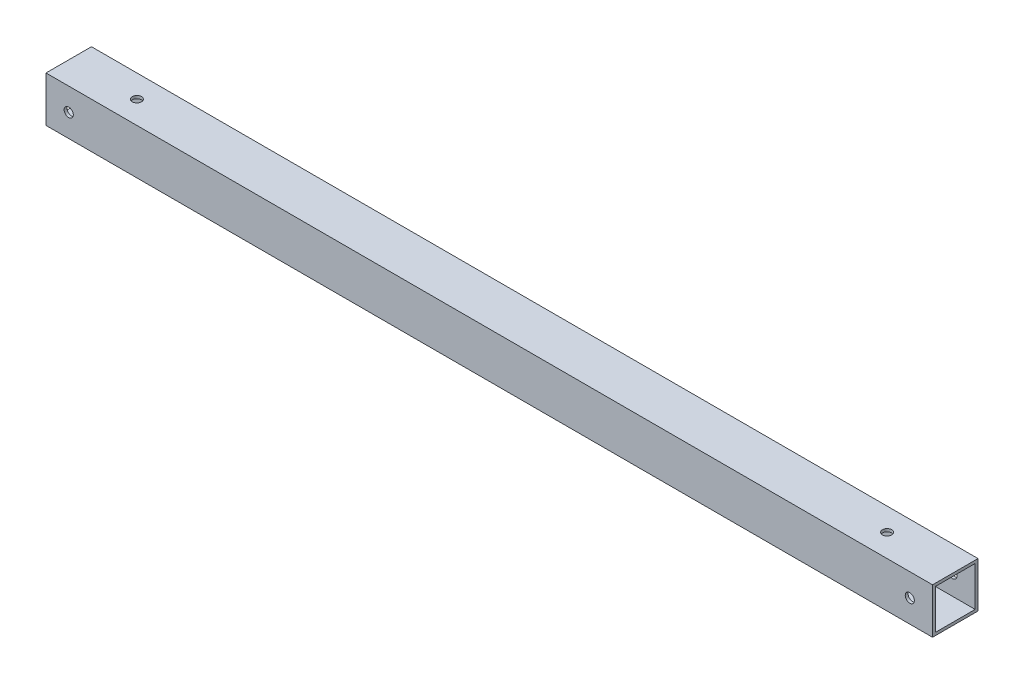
ISO-10303-21;
HEADER;
FILE_DESCRIPTION(('STEP AP214'),'2;1');
FILE_NAME('part.step','',(''),(''),'','','');
FILE_SCHEMA(('AUTOMOTIVE_DESIGN { 1 0 10303 214 1 1 1 1 }'));
ENDSEC;
DATA;
#1=APPLICATION_CONTEXT('core data for automotive mechanical design processes');
#2=APPLICATION_PROTOCOL_DEFINITION('international standard','automotive_design',2000,#1);
#3=PRODUCT_CONTEXT('',#1,'mechanical');
#4=PRODUCT('Part','Part','',(#3));
#5=PRODUCT_RELATED_PRODUCT_CATEGORY('part','',(#4));
#6=PRODUCT_DEFINITION_FORMATION('','',#4);
#7=PRODUCT_DEFINITION_CONTEXT('part definition',#1,'design');
#8=PRODUCT_DEFINITION('design','',#6,#7);
#9=PRODUCT_DEFINITION_SHAPE('','',#8);
#10=(LENGTH_UNIT() NAMED_UNIT(*) SI_UNIT(.MILLI.,.METRE.));
#11=(NAMED_UNIT(*) PLANE_ANGLE_UNIT() SI_UNIT($,.RADIAN.));
#12=(NAMED_UNIT(*) SI_UNIT($,.STERADIAN.) SOLID_ANGLE_UNIT());
#13=UNCERTAINTY_MEASURE_WITH_UNIT(LENGTH_MEASURE(1.E-05),#10,'distance_accuracy_value','');
#14=(GEOMETRIC_REPRESENTATION_CONTEXT(3) GLOBAL_UNCERTAINTY_ASSIGNED_CONTEXT((#13)) GLOBAL_UNIT_ASSIGNED_CONTEXT((#10,
#11,#12)) REPRESENTATION_CONTEXT('',''));
#15=CARTESIAN_POINT('',(0.,0.,0.));
#16=DIRECTION('',(0.,0.,1.));
#17=DIRECTION('',(1.,0.,0.));
#18=AXIS2_PLACEMENT_3D('',#15,#16,#17);
#19=CARTESIAN_POINT('',(495.3,0.,0.));
#20=DIRECTION('',(-1.,0.,0.));
#21=DIRECTION('',(0.,0.,1.));
#22=AXIS2_PLACEMENT_3D('',#19,#20,#21);
#23=PLANE('',#22);
#24=DIRECTION('',(0.,1.,0.));
#25=VECTOR('',#24,1.);
#26=CARTESIAN_POINT('',(495.3,-12.7,-12.7));
#27=LINE('',#26,#25);
#28=CARTESIAN_POINT('',(495.3,-12.7,-12.7));
#29=VERTEX_POINT('',#28);
#30=CARTESIAN_POINT('',(495.3,12.7,-12.7));
#31=VERTEX_POINT('',#30);
#32=EDGE_CURVE('E155',#29,#31,#27,.T.);
#33=ORIENTED_EDGE('',*,*,#32,.T.);
#34=DIRECTION('',(0.,0.,1.));
#35=VECTOR('',#34,1.);
#36=CARTESIAN_POINT('',(495.3,12.7,12.7));
#37=LINE('',#36,#35);
#38=CARTESIAN_POINT('',(495.3,12.7,12.7));
#39=VERTEX_POINT('',#38);
#40=EDGE_CURVE('E159',#31,#39,#37,.T.);
#41=ORIENTED_EDGE('',*,*,#40,.T.);
#42=DIRECTION('',(0.,-1.,0.));
#43=VECTOR('',#42,1.);
#44=CARTESIAN_POINT('',(495.3,-12.7,12.7));
#45=LINE('',#44,#43);
#46=CARTESIAN_POINT('',(495.3,-12.7,12.7));
#47=VERTEX_POINT('',#46);
#48=EDGE_CURVE('E163',#39,#47,#45,.T.);
#49=ORIENTED_EDGE('',*,*,#48,.T.);
#50=DIRECTION('',(0.,0.,-1.));
#51=VECTOR('',#50,1.);
#52=CARTESIAN_POINT('',(495.3,-12.7,12.7));
#53=LINE('',#52,#51);
#54=EDGE_CURVE('E166',#47,#29,#53,.T.);
#55=ORIENTED_EDGE('',*,*,#54,.T.);
#56=EDGE_LOOP('',(#33,#41,#49,#55));
#57=FACE_BOUND('',#56,.T.);
#58=DIRECTION('',(0.,1.,0.));
#59=VECTOR('',#58,1.);
#60=CARTESIAN_POINT('',(495.3,-11.1125,-11.1125));
#61=LINE('',#60,#59);
#62=CARTESIAN_POINT('',(495.3,-11.1125,-11.1125));
#63=VERTEX_POINT('',#62);
#64=CARTESIAN_POINT('',(495.3,11.1125,-11.1125));
#65=VERTEX_POINT('',#64);
#66=EDGE_CURVE('E104',#63,#65,#61,.T.);
#67=ORIENTED_EDGE('',*,*,#66,.F.);
#68=DIRECTION('',(0.,0.,-1.));
#69=VECTOR('',#68,1.);
#70=CARTESIAN_POINT('',(495.3,-11.1125,11.1125));
#71=LINE('',#70,#69);
#72=CARTESIAN_POINT('',(495.3,-11.1125,11.1125));
#73=VERTEX_POINT('',#72);
#74=EDGE_CURVE('E131',#73,#63,#71,.T.);
#75=ORIENTED_EDGE('',*,*,#74,.F.);
#76=DIRECTION('',(0.,-1.,0.));
#77=VECTOR('',#76,1.);
#78=CARTESIAN_POINT('',(495.3,-11.1125,11.1125));
#79=LINE('',#78,#77);
#80=CARTESIAN_POINT('',(495.3,11.1125,11.1125));
#81=VERTEX_POINT('',#80);
#82=EDGE_CURVE('E126',#81,#73,#79,.T.);
#83=ORIENTED_EDGE('',*,*,#82,.F.);
#84=DIRECTION('',(0.,0.,1.));
#85=VECTOR('',#84,1.);
#86=CARTESIAN_POINT('',(495.3,11.1125,11.1125));
#87=LINE('',#86,#85);
#88=EDGE_CURVE('E113',#65,#81,#87,.T.);
#89=ORIENTED_EDGE('',*,*,#88,.F.);
#90=EDGE_LOOP('',(#67,#75,#83,#89));
#91=FACE_BOUND('',#90,.T.);
#92=ADVANCED_FACE('F36',(#57,#91),#23,.F.);
#93=CARTESIAN_POINT('',(0.,0.,0.));
#94=DIRECTION('',(-1.,0.,0.));
#95=DIRECTION('',(0.,0.,1.));
#96=AXIS2_PLACEMENT_3D('',#93,#94,#95);
#97=PLANE('',#96);
#98=DIRECTION('',(0.,1.,0.));
#99=VECTOR('',#98,1.);
#100=CARTESIAN_POINT('',(0.,-12.7,-12.7));
#101=LINE('',#100,#99);
#102=CARTESIAN_POINT('',(0.,-12.7,-12.7));
#103=VERTEX_POINT('',#102);
#104=CARTESIAN_POINT('',(0.,12.7,-12.7));
#105=VERTEX_POINT('',#104);
#106=EDGE_CURVE('E122',#103,#105,#101,.T.);
#107=ORIENTED_EDGE('',*,*,#106,.F.);
#108=DIRECTION('',(0.,0.,-1.));
#109=VECTOR('',#108,1.);
#110=CARTESIAN_POINT('',(0.,-12.7,12.7));
#111=LINE('',#110,#109);
#112=CARTESIAN_POINT('',(0.,-12.7,12.7));
#113=VERTEX_POINT('',#112);
#114=EDGE_CURVE('E160',#113,#103,#111,.T.);
#115=ORIENTED_EDGE('',*,*,#114,.F.);
#116=DIRECTION('',(0.,-1.,0.));
#117=VECTOR('',#116,1.);
#118=CARTESIAN_POINT('',(0.,-12.7,12.7));
#119=LINE('',#118,#117);
#120=CARTESIAN_POINT('',(0.,12.7,12.7));
#121=VERTEX_POINT('',#120);
#122=EDGE_CURVE('E176',#121,#113,#119,.T.);
#123=ORIENTED_EDGE('',*,*,#122,.F.);
#124=DIRECTION('',(0.,0.,1.));
#125=VECTOR('',#124,1.);
#126=CARTESIAN_POINT('',(0.,12.7,12.7));
#127=LINE('',#126,#125);
#128=EDGE_CURVE('E173',#105,#121,#127,.T.);
#129=ORIENTED_EDGE('',*,*,#128,.F.);
#130=EDGE_LOOP('',(#107,#115,#123,#129));
#131=FACE_BOUND('',#130,.T.);
#132=DIRECTION('',(0.,0.,-1.));
#133=VECTOR('',#132,1.);
#134=CARTESIAN_POINT('',(0.,-11.1125,11.1125));
#135=LINE('',#134,#133);
#136=CARTESIAN_POINT('',(0.,-11.1125,11.1125));
#137=VERTEX_POINT('',#136);
#138=CARTESIAN_POINT('',(0.,-11.1125,-11.1125));
#139=VERTEX_POINT('',#138);
#140=EDGE_CURVE('E114',#137,#139,#135,.T.);
#141=ORIENTED_EDGE('',*,*,#140,.T.);
#142=DIRECTION('',(0.,1.,0.));
#143=VECTOR('',#142,1.);
#144=CARTESIAN_POINT('',(0.,-11.1125,-11.1125));
#145=LINE('',#144,#143);
#146=CARTESIAN_POINT('',(0.,11.1125,-11.1125));
#147=VERTEX_POINT('',#146);
#148=EDGE_CURVE('E62',#139,#147,#145,.T.);
#149=ORIENTED_EDGE('',*,*,#148,.T.);
#150=DIRECTION('',(0.,0.,1.));
#151=VECTOR('',#150,1.);
#152=CARTESIAN_POINT('',(0.,11.1125,11.1125));
#153=LINE('',#152,#151);
#154=CARTESIAN_POINT('',(0.,11.1125,11.1125));
#155=VERTEX_POINT('',#154);
#156=EDGE_CURVE('E120',#147,#155,#153,.T.);
#157=ORIENTED_EDGE('',*,*,#156,.T.);
#158=DIRECTION('',(0.,-1.,0.));
#159=VECTOR('',#158,1.);
#160=CARTESIAN_POINT('',(0.,-11.1125,11.1125));
#161=LINE('',#160,#159);
#162=EDGE_CURVE('E142',#155,#137,#161,.T.);
#163=ORIENTED_EDGE('',*,*,#162,.T.);
#164=EDGE_LOOP('',(#141,#149,#157,#163));
#165=FACE_BOUND('',#164,.T.);
#166=ADVANCED_FACE('F249',(#131,#165),#97,.T.);
#167=CARTESIAN_POINT('',(495.3,-12.7,-12.7));
#168=DIRECTION('',(0.,0.,1.));
#169=DIRECTION('',(1.,0.,0.));
#170=AXIS2_PLACEMENT_3D('',#167,#168,#169);
#171=PLANE('',#170);
#172=CARTESIAN_POINT('',(482.6,0.,-12.7));
#173=DIRECTION('',(0.,0.,1.));
#174=DIRECTION('',(1.,0.,0.));
#175=AXIS2_PLACEMENT_3D('',#172,#173,#174);
#176=CIRCLE('',#175,2.55270000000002);
#177=CARTESIAN_POINT('',(485.1527,0.,-12.7));
#178=VERTEX_POINT('',#177);
#179=EDGE_CURVE('E323',#178,#178,#176,.T.);
#180=ORIENTED_EDGE('',*,*,#179,.T.);
#181=EDGE_LOOP('',(#180));
#182=FACE_BOUND('',#181,.T.);
#183=CARTESIAN_POINT('',(12.7,0.,-12.7));
#184=DIRECTION('',(0.,0.,1.));
#185=DIRECTION('',(1.,0.,0.));
#186=AXIS2_PLACEMENT_3D('',#183,#184,#185);
#187=CIRCLE('',#186,2.55269999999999);
#188=CARTESIAN_POINT('',(15.2527,0.,-12.7));
#189=VERTEX_POINT('',#188);
#190=EDGE_CURVE('E342',#189,#189,#187,.T.);
#191=ORIENTED_EDGE('',*,*,#190,.T.);
#192=EDGE_LOOP('',(#191));
#193=FACE_BOUND('',#192,.T.);
#194=ORIENTED_EDGE('',*,*,#106,.T.);
#195=DIRECTION('',(-1.,0.,0.));
#196=VECTOR('',#195,1.);
#197=CARTESIAN_POINT('',(495.3,12.7,-12.7));
#198=LINE('',#197,#196);
#199=EDGE_CURVE('E11',#31,#105,#198,.T.);
#200=ORIENTED_EDGE('',*,*,#199,.F.);
#201=ORIENTED_EDGE('',*,*,#32,.F.);
#202=DIRECTION('',(-1.,0.,0.));
#203=VECTOR('',#202,1.);
#204=CARTESIAN_POINT('',(495.3,-12.7,-12.7));
#205=LINE('',#204,#203);
#206=EDGE_CURVE('E169',#29,#103,#205,.T.);
#207=ORIENTED_EDGE('',*,*,#206,.T.);
#208=EDGE_LOOP('',(#194,#200,#201,#207));
#209=FACE_BOUND('',#208,.T.);
#210=ADVANCED_FACE('F38',(#182,#193,#209),#171,.F.);
#211=CARTESIAN_POINT('',(495.3,12.7,12.7));
#212=DIRECTION('',(0.,-1.,0.));
#213=DIRECTION('',(0.,0.,-1.));
#214=AXIS2_PLACEMENT_3D('',#211,#212,#213);
#215=PLANE('',#214);
#216=CARTESIAN_POINT('',(38.1,12.7,0.));
#217=DIRECTION('',(0.,1.,0.));
#218=DIRECTION('',(0.,0.,1.));
#219=AXIS2_PLACEMENT_3D('',#216,#217,#218);
#220=CIRCLE('',#219,2.5527);
#221=CARTESIAN_POINT('',(38.1,12.7,2.5527));
#222=VERTEX_POINT('',#221);
#223=EDGE_CURVE('E209',#222,#222,#220,.T.);
#224=ORIENTED_EDGE('',*,*,#223,.F.);
#225=EDGE_LOOP('',(#224));
#226=FACE_BOUND('',#225,.T.);
#227=CARTESIAN_POINT('',(457.2,12.7,0.));
#228=DIRECTION('',(0.,1.,0.));
#229=DIRECTION('',(0.,0.,1.));
#230=AXIS2_PLACEMENT_3D('',#227,#228,#229);
#231=CIRCLE('',#230,2.55270000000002);
#232=CARTESIAN_POINT('',(457.2,12.7,2.55270000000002));
#233=VERTEX_POINT('',#232);
#234=EDGE_CURVE('E206',#233,#233,#231,.T.);
#235=ORIENTED_EDGE('',*,*,#234,.F.);
#236=EDGE_LOOP('',(#235));
#237=FACE_BOUND('',#236,.T.);
#238=ORIENTED_EDGE('',*,*,#128,.T.);
#239=DIRECTION('',(-1.,0.,0.));
#240=VECTOR('',#239,1.);
#241=CARTESIAN_POINT('',(495.3,12.7,12.7));
#242=LINE('',#241,#240);
#243=EDGE_CURVE('E46',#39,#121,#242,.T.);
#244=ORIENTED_EDGE('',*,*,#243,.F.);
#245=ORIENTED_EDGE('',*,*,#40,.F.);
#246=ORIENTED_EDGE('',*,*,#199,.T.);
#247=EDGE_LOOP('',(#238,#244,#245,#246));
#248=FACE_BOUND('',#247,.T.);
#249=ADVANCED_FACE('F262',(#226,#237,#248),#215,.F.);
#250=CARTESIAN_POINT('',(495.3,-12.7,12.7));
#251=DIRECTION('',(0.,0.,-1.));
#252=DIRECTION('',(-1.,0.,0.));
#253=AXIS2_PLACEMENT_3D('',#250,#251,#252);
#254=PLANE('',#253);
#255=CARTESIAN_POINT('',(482.6,0.,12.7));
#256=DIRECTION('',(0.,0.,1.));
#257=DIRECTION('',(1.,0.,0.));
#258=AXIS2_PLACEMENT_3D('',#255,#256,#257);
#259=CIRCLE('',#258,2.55269999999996);
#260=CARTESIAN_POINT('',(485.1527,0.,12.7));
#261=VERTEX_POINT('',#260);
#262=EDGE_CURVE('E325',#261,#261,#259,.T.);
#263=ORIENTED_EDGE('',*,*,#262,.F.);
#264=EDGE_LOOP('',(#263));
#265=FACE_BOUND('',#264,.T.);
#266=CARTESIAN_POINT('',(12.7,0.,12.7));
#267=DIRECTION('',(0.,0.,1.));
#268=DIRECTION('',(1.,0.,0.));
#269=AXIS2_PLACEMENT_3D('',#266,#267,#268);
#270=CIRCLE('',#269,2.55269999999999);
#271=CARTESIAN_POINT('',(15.2527,0.,12.7));
#272=VERTEX_POINT('',#271);
#273=EDGE_CURVE('E338',#272,#272,#270,.T.);
#274=ORIENTED_EDGE('',*,*,#273,.F.);
#275=EDGE_LOOP('',(#274));
#276=FACE_BOUND('',#275,.T.);
#277=ORIENTED_EDGE('',*,*,#122,.T.);
#278=DIRECTION('',(-1.,0.,0.));
#279=VECTOR('',#278,1.);
#280=CARTESIAN_POINT('',(495.3,-12.7,12.7));
#281=LINE('',#280,#279);
#282=EDGE_CURVE('E184',#47,#113,#281,.T.);
#283=ORIENTED_EDGE('',*,*,#282,.F.);
#284=ORIENTED_EDGE('',*,*,#48,.F.);
#285=ORIENTED_EDGE('',*,*,#243,.T.);
#286=EDGE_LOOP('',(#277,#283,#284,#285));
#287=FACE_BOUND('',#286,.T.);
#288=ADVANCED_FACE('F260',(#265,#276,#287),#254,.F.);
#289=CARTESIAN_POINT('',(495.3,-12.7,12.7));
#290=DIRECTION('',(0.,1.,0.));
#291=DIRECTION('',(0.,0.,1.));
#292=AXIS2_PLACEMENT_3D('',#289,#290,#291);
#293=PLANE('',#292);
#294=CARTESIAN_POINT('',(38.1,-12.7,0.));
#295=DIRECTION('',(0.,1.,0.));
#296=DIRECTION('',(0.,0.,1.));
#297=AXIS2_PLACEMENT_3D('',#294,#295,#296);
#298=CIRCLE('',#297,2.55269999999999);
#299=CARTESIAN_POINT('',(38.1,-12.7,2.55269999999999));
#300=VERTEX_POINT('',#299);
#301=EDGE_CURVE('E199',#300,#300,#298,.T.);
#302=ORIENTED_EDGE('',*,*,#301,.T.);
#303=EDGE_LOOP('',(#302));
#304=FACE_BOUND('',#303,.T.);
#305=CARTESIAN_POINT('',(457.2,-12.7,0.));
#306=DIRECTION('',(0.,1.,0.));
#307=DIRECTION('',(0.,0.,1.));
#308=AXIS2_PLACEMENT_3D('',#305,#306,#307);
#309=CIRCLE('',#308,2.55270000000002);
#310=CARTESIAN_POINT('',(457.2,-12.7,2.55270000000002));
#311=VERTEX_POINT('',#310);
#312=EDGE_CURVE('E194',#311,#311,#309,.T.);
#313=ORIENTED_EDGE('',*,*,#312,.T.);
#314=EDGE_LOOP('',(#313));
#315=FACE_BOUND('',#314,.T.);
#316=ORIENTED_EDGE('',*,*,#114,.T.);
#317=ORIENTED_EDGE('',*,*,#206,.F.);
#318=ORIENTED_EDGE('',*,*,#54,.F.);
#319=ORIENTED_EDGE('',*,*,#282,.T.);
#320=EDGE_LOOP('',(#316,#317,#318,#319));
#321=FACE_BOUND('',#320,.T.);
#322=ADVANCED_FACE('F244',(#304,#315,#321),#293,.F.);
#323=CARTESIAN_POINT('',(495.3,-11.1125,-11.1125));
#324=DIRECTION('',(0.,0.,1.));
#325=DIRECTION('',(1.,0.,0.));
#326=AXIS2_PLACEMENT_3D('',#323,#324,#325);
#327=PLANE('',#326);
#328=CARTESIAN_POINT('',(482.6,0.,-11.1125));
#329=DIRECTION('',(0.,0.,1.));
#330=DIRECTION('',(1.,0.,0.));
#331=AXIS2_PLACEMENT_3D('',#328,#329,#330);
#332=CIRCLE('',#331,2.55269999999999);
#333=CARTESIAN_POINT('',(485.1527,0.,-11.1125));
#334=VERTEX_POINT('',#333);
#335=EDGE_CURVE('E320',#334,#334,#332,.T.);
#336=ORIENTED_EDGE('',*,*,#335,.F.);
#337=EDGE_LOOP('',(#336));
#338=FACE_BOUND('',#337,.T.);
#339=CARTESIAN_POINT('',(12.7,0.,-11.1125));
#340=DIRECTION('',(0.,0.,1.));
#341=DIRECTION('',(1.,0.,0.));
#342=AXIS2_PLACEMENT_3D('',#339,#340,#341);
#343=CIRCLE('',#342,2.55269999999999);
#344=CARTESIAN_POINT('',(15.2527,0.,-11.1125));
#345=VERTEX_POINT('',#344);
#346=EDGE_CURVE('E216',#345,#345,#343,.T.);
#347=ORIENTED_EDGE('',*,*,#346,.F.);
#348=EDGE_LOOP('',(#347));
#349=FACE_BOUND('',#348,.T.);
#350=ORIENTED_EDGE('',*,*,#148,.F.);
#351=DIRECTION('',(-1.,0.,0.));
#352=VECTOR('',#351,1.);
#353=CARTESIAN_POINT('',(495.3,-11.1125,-11.1125));
#354=LINE('',#353,#352);
#355=EDGE_CURVE('E108',#63,#139,#354,.T.);
#356=ORIENTED_EDGE('',*,*,#355,.F.);
#357=ORIENTED_EDGE('',*,*,#66,.T.);
#358=DIRECTION('',(-1.,0.,0.));
#359=VECTOR('',#358,1.);
#360=CARTESIAN_POINT('',(495.3,11.1125,-11.1125));
#361=LINE('',#360,#359);
#362=EDGE_CURVE('E107',#65,#147,#361,.T.);
#363=ORIENTED_EDGE('',*,*,#362,.T.);
#364=EDGE_LOOP('',(#350,#356,#357,#363));
#365=FACE_BOUND('',#364,.T.);
#366=ADVANCED_FACE('F106',(#338,#349,#365),#327,.T.);
#367=CARTESIAN_POINT('',(495.3,11.1125,11.1125));
#368=DIRECTION('',(0.,-1.,0.));
#369=DIRECTION('',(0.,0.,-1.));
#370=AXIS2_PLACEMENT_3D('',#367,#368,#369);
#371=PLANE('',#370);
#372=CARTESIAN_POINT('',(38.1,11.1125,0.));
#373=DIRECTION('',(0.,-1.,0.));
#374=DIRECTION('',(0.,0.,-1.));
#375=AXIS2_PLACEMENT_3D('',#372,#373,#374);
#376=CIRCLE('',#375,2.55269999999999);
#377=CARTESIAN_POINT('',(38.1,11.1125,-2.55269999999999));
#378=VERTEX_POINT('',#377);
#379=EDGE_CURVE('E198',#378,#378,#376,.T.);
#380=ORIENTED_EDGE('',*,*,#379,.F.);
#381=EDGE_LOOP('',(#380));
#382=FACE_BOUND('',#381,.T.);
#383=CARTESIAN_POINT('',(457.2,11.1125,0.));
#384=DIRECTION('',(0.,-1.,0.));
#385=DIRECTION('',(0.,0.,-1.));
#386=AXIS2_PLACEMENT_3D('',#383,#384,#385);
#387=CIRCLE('',#386,2.55270000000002);
#388=CARTESIAN_POINT('',(457.2,11.1125,-2.55270000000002));
#389=VERTEX_POINT('',#388);
#390=EDGE_CURVE('E139',#389,#389,#387,.T.);
#391=ORIENTED_EDGE('',*,*,#390,.F.);
#392=EDGE_LOOP('',(#391));
#393=FACE_BOUND('',#392,.T.);
#394=ORIENTED_EDGE('',*,*,#156,.F.);
#395=ORIENTED_EDGE('',*,*,#362,.F.);
#396=ORIENTED_EDGE('',*,*,#88,.T.);
#397=DIRECTION('',(-1.,0.,0.));
#398=VECTOR('',#397,1.);
#399=CARTESIAN_POINT('',(495.3,11.1125,11.1125));
#400=LINE('',#399,#398);
#401=EDGE_CURVE('E123',#81,#155,#400,.T.);
#402=ORIENTED_EDGE('',*,*,#401,.T.);
#403=EDGE_LOOP('',(#394,#395,#396,#402));
#404=FACE_BOUND('',#403,.T.);
#405=ADVANCED_FACE('F117',(#382,#393,#404),#371,.T.);
#406=CARTESIAN_POINT('',(495.3,-11.1125,11.1125));
#407=DIRECTION('',(0.,0.,-1.));
#408=DIRECTION('',(-1.,0.,0.));
#409=AXIS2_PLACEMENT_3D('',#406,#407,#408);
#410=PLANE('',#409);
#411=CARTESIAN_POINT('',(482.6,0.,11.1125));
#412=DIRECTION('',(0.,0.,-1.));
#413=DIRECTION('',(-1.,0.,0.));
#414=AXIS2_PLACEMENT_3D('',#411,#412,#413);
#415=CIRCLE('',#414,2.55269999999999);
#416=CARTESIAN_POINT('',(480.0473,0.,11.1125));
#417=VERTEX_POINT('',#416);
#418=EDGE_CURVE('E330',#417,#417,#415,.T.);
#419=ORIENTED_EDGE('',*,*,#418,.F.);
#420=EDGE_LOOP('',(#419));
#421=FACE_BOUND('',#420,.T.);
#422=CARTESIAN_POINT('',(12.7,0.,11.1125));
#423=DIRECTION('',(0.,0.,-1.));
#424=DIRECTION('',(-1.,0.,0.));
#425=AXIS2_PLACEMENT_3D('',#422,#423,#424);
#426=CIRCLE('',#425,2.55269999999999);
#427=CARTESIAN_POINT('',(10.1473,0.,11.1125));
#428=VERTEX_POINT('',#427);
#429=EDGE_CURVE('E40',#428,#428,#426,.T.);
#430=ORIENTED_EDGE('',*,*,#429,.F.);
#431=EDGE_LOOP('',(#430));
#432=FACE_BOUND('',#431,.T.);
#433=ORIENTED_EDGE('',*,*,#162,.F.);
#434=ORIENTED_EDGE('',*,*,#401,.F.);
#435=ORIENTED_EDGE('',*,*,#82,.T.);
#436=DIRECTION('',(-1.,0.,0.));
#437=VECTOR('',#436,1.);
#438=CARTESIAN_POINT('',(495.3,-11.1125,11.1125));
#439=LINE('',#438,#437);
#440=EDGE_CURVE('E54',#73,#137,#439,.T.);
#441=ORIENTED_EDGE('',*,*,#440,.T.);
#442=EDGE_LOOP('',(#433,#434,#435,#441));
#443=FACE_BOUND('',#442,.T.);
#444=ADVANCED_FACE('F234',(#421,#432,#443),#410,.T.);
#445=CARTESIAN_POINT('',(495.3,-11.1125,11.1125));
#446=DIRECTION('',(0.,1.,0.));
#447=DIRECTION('',(0.,0.,1.));
#448=AXIS2_PLACEMENT_3D('',#445,#446,#447);
#449=PLANE('',#448);
#450=CARTESIAN_POINT('',(38.1,-11.1125,0.));
#451=DIRECTION('',(0.,1.,0.));
#452=DIRECTION('',(0.,0.,1.));
#453=AXIS2_PLACEMENT_3D('',#450,#451,#452);
#454=CIRCLE('',#453,2.55269999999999);
#455=CARTESIAN_POINT('',(38.1,-11.1125,2.55269999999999));
#456=VERTEX_POINT('',#455);
#457=EDGE_CURVE('E195',#456,#456,#454,.T.);
#458=ORIENTED_EDGE('',*,*,#457,.F.);
#459=EDGE_LOOP('',(#458));
#460=FACE_BOUND('',#459,.T.);
#461=CARTESIAN_POINT('',(457.2,-11.1125,0.));
#462=DIRECTION('',(0.,1.,0.));
#463=DIRECTION('',(0.,0.,1.));
#464=AXIS2_PLACEMENT_3D('',#461,#462,#463);
#465=CIRCLE('',#464,2.55270000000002);
#466=CARTESIAN_POINT('',(457.2,-11.1125,2.55270000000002));
#467=VERTEX_POINT('',#466);
#468=EDGE_CURVE('E191',#467,#467,#465,.T.);
#469=ORIENTED_EDGE('',*,*,#468,.F.);
#470=EDGE_LOOP('',(#469));
#471=FACE_BOUND('',#470,.T.);
#472=ORIENTED_EDGE('',*,*,#140,.F.);
#473=ORIENTED_EDGE('',*,*,#440,.F.);
#474=ORIENTED_EDGE('',*,*,#74,.T.);
#475=ORIENTED_EDGE('',*,*,#355,.T.);
#476=EDGE_LOOP('',(#472,#473,#474,#475));
#477=FACE_BOUND('',#476,.T.);
#478=ADVANCED_FACE('F241',(#460,#471,#477),#449,.T.);
#479=CARTESIAN_POINT('',(457.2,12.7,0.));
#480=DIRECTION('',(0.,1.,0.));
#481=DIRECTION('',(0.,0.,1.));
#482=AXIS2_PLACEMENT_3D('',#479,#480,#481);
#483=CYLINDRICAL_SURFACE('',#482,2.55270000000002);
#484=ORIENTED_EDGE('',*,*,#468,.T.);
#485=EDGE_LOOP('',(#484));
#486=FACE_BOUND('',#485,.T.);
#487=ORIENTED_EDGE('',*,*,#312,.F.);
#488=EDGE_LOOP('',(#487));
#489=FACE_BOUND('',#488,.T.);
#490=ADVANCED_FACE('F290',(#486,#489),#483,.F.);
#491=ORIENTED_EDGE('',*,*,#390,.T.);
#492=EDGE_LOOP('',(#491));
#493=FACE_BOUND('',#492,.T.);
#494=ORIENTED_EDGE('',*,*,#234,.T.);
#495=EDGE_LOOP('',(#494));
#496=FACE_BOUND('',#495,.T.);
#497=ADVANCED_FACE('F230',(#493,#496),#483,.F.);
#498=CARTESIAN_POINT('',(38.1,12.7,0.));
#499=DIRECTION('',(0.,1.,0.));
#500=DIRECTION('',(0.,0.,1.));
#501=AXIS2_PLACEMENT_3D('',#498,#499,#500);
#502=CYLINDRICAL_SURFACE('',#501,2.55269999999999);
#503=ORIENTED_EDGE('',*,*,#457,.T.);
#504=EDGE_LOOP('',(#503));
#505=FACE_BOUND('',#504,.T.);
#506=ORIENTED_EDGE('',*,*,#301,.F.);
#507=EDGE_LOOP('',(#506));
#508=FACE_BOUND('',#507,.T.);
#509=ADVANCED_FACE('F300',(#505,#508),#502,.F.);
#510=ORIENTED_EDGE('',*,*,#379,.T.);
#511=EDGE_LOOP('',(#510));
#512=FACE_BOUND('',#511,.T.);
#513=ORIENTED_EDGE('',*,*,#223,.T.);
#514=EDGE_LOOP('',(#513));
#515=FACE_BOUND('',#514,.T.);
#516=ADVANCED_FACE('F303',(#512,#515),#502,.F.);
#517=CARTESIAN_POINT('',(12.7,0.,12.7));
#518=DIRECTION('',(0.,0.,1.));
#519=DIRECTION('',(1.,0.,0.));
#520=AXIS2_PLACEMENT_3D('',#517,#518,#519);
#521=CYLINDRICAL_SURFACE('',#520,2.55269999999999);
#522=ORIENTED_EDGE('',*,*,#429,.T.);
#523=EDGE_LOOP('',(#522));
#524=FACE_BOUND('',#523,.T.);
#525=ORIENTED_EDGE('',*,*,#273,.T.);
#526=EDGE_LOOP('',(#525));
#527=FACE_BOUND('',#526,.T.);
#528=ADVANCED_FACE('F304',(#524,#527),#521,.F.);
#529=ORIENTED_EDGE('',*,*,#346,.T.);
#530=EDGE_LOOP('',(#529));
#531=FACE_BOUND('',#530,.T.);
#532=ORIENTED_EDGE('',*,*,#190,.F.);
#533=EDGE_LOOP('',(#532));
#534=FACE_BOUND('',#533,.T.);
#535=ADVANCED_FACE('F307',(#531,#534),#521,.F.);
#536=CARTESIAN_POINT('',(482.6,0.,12.7));
#537=DIRECTION('',(0.,0.,1.));
#538=DIRECTION('',(1.,0.,0.));
#539=AXIS2_PLACEMENT_3D('',#536,#537,#538);
#540=CYLINDRICAL_SURFACE('',#539,2.55269999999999);
#541=ORIENTED_EDGE('',*,*,#418,.T.);
#542=EDGE_LOOP('',(#541));
#543=FACE_BOUND('',#542,.T.);
#544=ORIENTED_EDGE('',*,*,#262,.T.);
#545=EDGE_LOOP('',(#544));
#546=FACE_BOUND('',#545,.T.);
#547=ADVANCED_FACE('F311',(#543,#546),#540,.F.);
#548=ORIENTED_EDGE('',*,*,#335,.T.);
#549=EDGE_LOOP('',(#548));
#550=FACE_BOUND('',#549,.T.);
#551=ORIENTED_EDGE('',*,*,#179,.F.);
#552=EDGE_LOOP('',(#551));
#553=FACE_BOUND('',#552,.T.);
#554=ADVANCED_FACE('F309',(#550,#553),#540,.F.);
#555=CLOSED_SHELL('',(#92,#166,#210,#249,#288,#322,#366,#405,#444,#478,#490,#497,#509,#516,#528,
#535,#547,#554));
#556=MANIFOLD_SOLID_BREP('B2',#555);
#557=ADVANCED_BREP_SHAPE_REPRESENTATION('',(#18,#556),#14);
#558=SHAPE_DEFINITION_REPRESENTATION(#9,#557);
ENDSEC;
END-ISO-10303-21;
